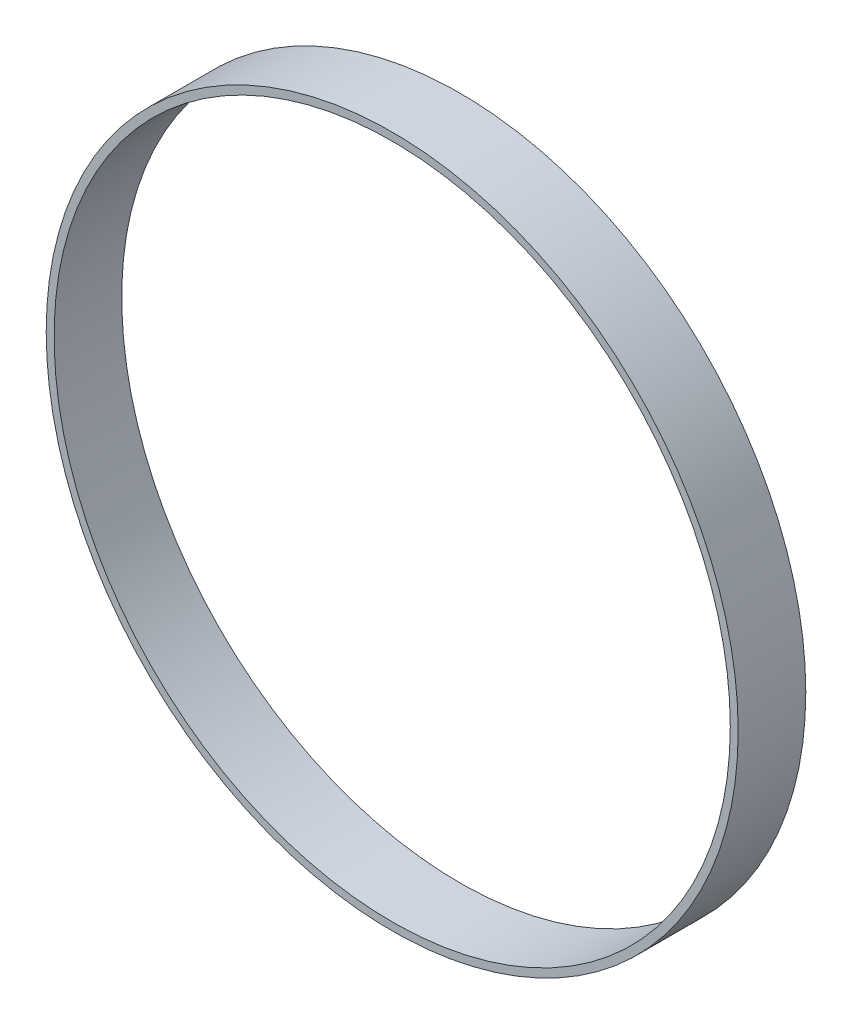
ISO-10303-21;
HEADER;
FILE_DESCRIPTION(('STEP AP214'),'2;1');
FILE_NAME('part.step','',(''),(''),'','','');
FILE_SCHEMA(('AUTOMOTIVE_DESIGN { 1 0 10303 214 1 1 1 1 }'));
ENDSEC;
DATA;
#1=APPLICATION_CONTEXT('core data for automotive mechanical design processes');
#2=APPLICATION_PROTOCOL_DEFINITION('international standard','automotive_design',2000,#1);
#3=PRODUCT_CONTEXT('',#1,'mechanical');
#4=PRODUCT('Part','Part','',(#3));
#5=PRODUCT_RELATED_PRODUCT_CATEGORY('part','',(#4));
#6=PRODUCT_DEFINITION_FORMATION('','',#4);
#7=PRODUCT_DEFINITION_CONTEXT('part definition',#1,'design');
#8=PRODUCT_DEFINITION('design','',#6,#7);
#9=PRODUCT_DEFINITION_SHAPE('','',#8);
#10=(LENGTH_UNIT() NAMED_UNIT(*) SI_UNIT(.MILLI.,.METRE.));
#11=(NAMED_UNIT(*) PLANE_ANGLE_UNIT() SI_UNIT($,.RADIAN.));
#12=(NAMED_UNIT(*) SI_UNIT($,.STERADIAN.) SOLID_ANGLE_UNIT());
#13=UNCERTAINTY_MEASURE_WITH_UNIT(LENGTH_MEASURE(1.E-05),#10,'distance_accuracy_value','');
#14=(GEOMETRIC_REPRESENTATION_CONTEXT(3) GLOBAL_UNCERTAINTY_ASSIGNED_CONTEXT((#13)) GLOBAL_UNIT_ASSIGNED_CONTEXT((#10,
#11,#12)) REPRESENTATION_CONTEXT('',''));
#15=CARTESIAN_POINT('',(0.,0.,0.));
#16=DIRECTION('',(0.,0.,1.));
#17=DIRECTION('',(1.,0.,0.));
#18=AXIS2_PLACEMENT_3D('',#15,#16,#17);
#19=CARTESIAN_POINT('',(0.,0.,6.));
#20=DIRECTION('',(0.,0.,1.));
#21=DIRECTION('',(1.,0.,0.));
#22=AXIS2_PLACEMENT_3D('',#19,#20,#21);
#23=PLANE('',#22);
#24=CARTESIAN_POINT('',(0.,0.,6.));
#25=DIRECTION('',(0.,0.,1.));
#26=DIRECTION('',(1.,0.,0.));
#27=AXIS2_PLACEMENT_3D('',#24,#25,#26);
#28=CIRCLE('',#27,30.7);
#29=CARTESIAN_POINT('',(30.7,0.,6.));
#30=VERTEX_POINT('',#29);
#31=EDGE_CURVE('E10',#30,#30,#28,.T.);
#32=ORIENTED_EDGE('',*,*,#31,.T.);
#33=EDGE_LOOP('',(#32));
#34=FACE_BOUND('',#33,.T.);
#35=CARTESIAN_POINT('',(0.,0.,6.));
#36=DIRECTION('',(0.,0.,1.));
#37=DIRECTION('',(1.,0.,0.));
#38=AXIS2_PLACEMENT_3D('',#35,#36,#37);
#39=CIRCLE('',#38,30.);
#40=CARTESIAN_POINT('',(30.,0.,6.));
#41=VERTEX_POINT('',#40);
#42=EDGE_CURVE('E40',#41,#41,#39,.T.);
#43=ORIENTED_EDGE('',*,*,#42,.F.);
#44=EDGE_LOOP('',(#43));
#45=FACE_BOUND('',#44,.T.);
#46=ADVANCED_FACE('F29',(#34,#45),#23,.T.);
#47=CARTESIAN_POINT('',(0.,0.,0.));
#48=DIRECTION('',(0.,0.,1.));
#49=DIRECTION('',(1.,0.,0.));
#50=AXIS2_PLACEMENT_3D('',#47,#48,#49);
#51=PLANE('',#50);
#52=CARTESIAN_POINT('',(0.,0.,0.));
#53=DIRECTION('',(0.,0.,1.));
#54=DIRECTION('',(1.,0.,0.));
#55=AXIS2_PLACEMENT_3D('',#52,#53,#54);
#56=CIRCLE('',#55,30.7);
#57=CARTESIAN_POINT('',(30.7,0.,0.));
#58=VERTEX_POINT('',#57);
#59=EDGE_CURVE('E36',#58,#58,#56,.T.);
#60=ORIENTED_EDGE('',*,*,#59,.F.);
#61=EDGE_LOOP('',(#60));
#62=FACE_BOUND('',#61,.T.);
#63=CARTESIAN_POINT('',(0.,0.,0.));
#64=DIRECTION('',(0.,0.,1.));
#65=DIRECTION('',(1.,0.,0.));
#66=AXIS2_PLACEMENT_3D('',#63,#64,#65);
#67=CIRCLE('',#66,30.);
#68=CARTESIAN_POINT('',(30.,0.,0.));
#69=VERTEX_POINT('',#68);
#70=EDGE_CURVE('E44',#69,#69,#67,.T.);
#71=ORIENTED_EDGE('',*,*,#70,.T.);
#72=EDGE_LOOP('',(#71));
#73=FACE_BOUND('',#72,.T.);
#74=ADVANCED_FACE('F50',(#62,#73),#51,.F.);
#75=CARTESIAN_POINT('',(0.,0.,6.));
#76=DIRECTION('',(0.,0.,-1.));
#77=DIRECTION('',(-1.,0.,0.));
#78=AXIS2_PLACEMENT_3D('',#75,#76,#77);
#79=CYLINDRICAL_SURFACE('',#78,30.7);
#80=ORIENTED_EDGE('',*,*,#31,.F.);
#81=EDGE_LOOP('',(#80));
#82=FACE_BOUND('',#81,.T.);
#83=ORIENTED_EDGE('',*,*,#59,.T.);
#84=EDGE_LOOP('',(#83));
#85=FACE_BOUND('',#84,.T.);
#86=ADVANCED_FACE('F31',(#82,#85),#79,.T.);
#87=CARTESIAN_POINT('',(0.,0.,6.));
#88=DIRECTION('',(0.,0.,-1.));
#89=DIRECTION('',(-1.,0.,0.));
#90=AXIS2_PLACEMENT_3D('',#87,#88,#89);
#91=CYLINDRICAL_SURFACE('',#90,30.);
#92=ORIENTED_EDGE('',*,*,#42,.T.);
#93=EDGE_LOOP('',(#92));
#94=FACE_BOUND('',#93,.T.);
#95=ORIENTED_EDGE('',*,*,#70,.F.);
#96=EDGE_LOOP('',(#95));
#97=FACE_BOUND('',#96,.T.);
#98=ADVANCED_FACE('F52',(#94,#97),#91,.F.);
#99=CLOSED_SHELL('',(#46,#74,#86,#98));
#100=MANIFOLD_SOLID_BREP('B2',#99);
#101=ADVANCED_BREP_SHAPE_REPRESENTATION('',(#18,#100),#14);
#102=SHAPE_DEFINITION_REPRESENTATION(#9,#101);
ENDSEC;
END-ISO-10303-21;
